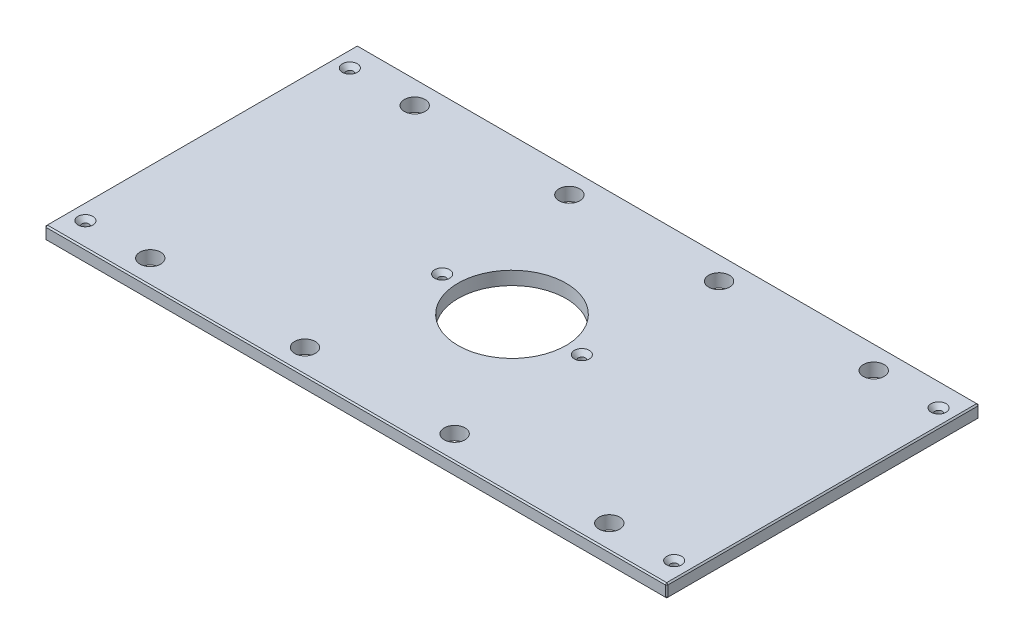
from build123d import *

# Parameters (mm, degrees)
SKETCH1_W                                        = 593.725
SKETCH1_H                                        = 298.45
BOSS_EXTRUDE1_DEPTH                              = 12.7
SKETCH13_R                                       = 51.562
CUT_EXTRUDE6_DEPTH                               = 333.500728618
F_25_32_0_78125_DIAMETER_HOLE1_D                 = 19.84375
CHAMFER2_SIZE                                    = 1.27
CSK_FOR_1_4_FLAT_HEAD_MACHINE_SCREW1_D           = 6.7564
CSK_FOR_1_4_FLAT_HEAD_MACHINE_SCREW1_CSINK_D     = 14.2748
CSK_FOR_1_4_FLAT_HEAD_MACHINE_SCREW1_CSINK_ANGLE = 82


with BuildPart() as part:
    # Sketch1 → Boss-Extrude1 (new body)
    with BuildSketch(Plane(origin=(0, 0, 0), x_dir=(1, 0, 0), z_dir=(0, 1, 0))):
        Rectangle(SKETCH1_W, SKETCH1_H)
    extrude(amount=BOSS_EXTRUDE1_DEPTH)

    # Sketch13 → Cut-Extrude6 (cut, through all)
    with BuildSketch(Plane(origin=(0, 12.7, 0), x_dir=(1, 0, 0), z_dir=(0, 1, 0))):
        with Locations(Location((0, 0, 0), (0, 0, 270))):
            Circle(SKETCH13_R)
    extrude(amount=-CUT_EXTRUDE6_DEPTH, mode=Mode.SUBTRACT)

    # 25_32 _0.78125_ Diameter Hole1 (through all)
    with Locations(Plane(origin=(0, 12.7, 0), x_dir=(1, 0, 0), z_dir=(0, 1, 0))):
        with Locations((219.075, 126.20498), (-219.075, 126.20498), (219.075, -126.20498), (-219.075, -126.20498), (-71.4375, 126.20498), (71.4375, 126.20498), (71.4375, -126.20498), (-71.4375, -126.20498)):
            Hole(F_25_32_0_78125_DIAMETER_HOLE1_D / 2)

    # Chamfer2
    chamfer2_edges = [part.edges().sort_by_distance(p)[0] for p in [
        (296.8625, 12.7, 0),
        (0, 12.7, -149.225),
        (-296.8625, 12.7, 0),
        (0, 0, -149.225),
        (296.8625, 0, 0),
        (0, 0, 149.225),
        (-296.8625, 0, 0),
        (0, 12.7, 149.225),
        (-296.8625, 6.35, -149.225),
        (296.8625, 6.35, -149.225),
        (296.8625, 6.35, 149.225),
        (-296.8625, 6.35, 149.225),
    ]]
    chamfer(chamfer2_edges, length=CHAMFER2_SIZE)

    # CSK for 1_4 Flat Head Machine Screw1 (through all)
    with Locations(Plane(origin=(0, 12.7, 0), x_dir=(1, 0, 0), z_dir=(0, 1, 0))):
        with Locations((280.9875, 126.20498), (280.9875, -126.20498), (-280.9875, -126.20498), (-66.675, 0), (66.675, 0), (-280.9875, 126.20498), (-219.075, 126.20498), (-219.075, -126.20498)):
            CounterSinkHole(CSK_FOR_1_4_FLAT_HEAD_MACHINE_SCREW1_D / 2, CSK_FOR_1_4_FLAT_HEAD_MACHINE_SCREW1_CSINK_D / 2, counter_sink_angle=CSK_FOR_1_4_FLAT_HEAD_MACHINE_SCREW1_CSINK_ANGLE)


solid = part.part
